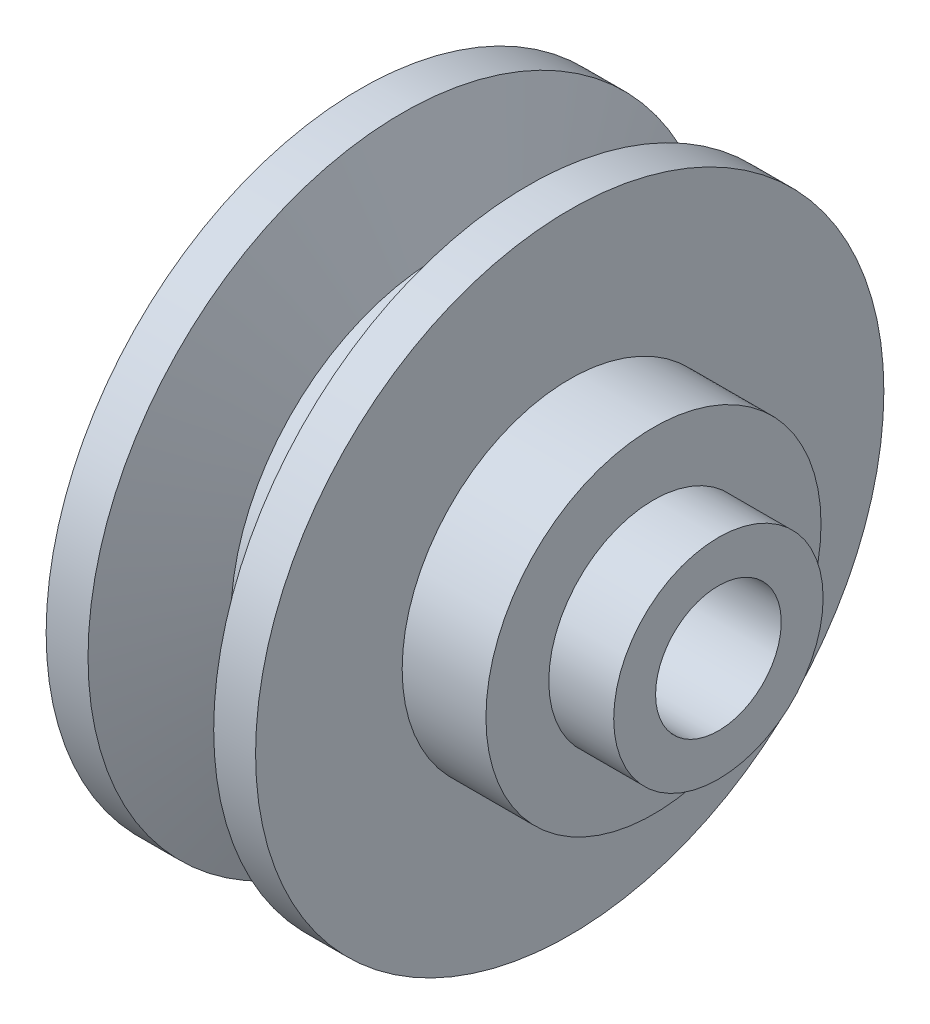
ISO-10303-21;
HEADER;
FILE_DESCRIPTION(('STEP AP214'),'2;1');
FILE_NAME('part.step','',(''),(''),'','','');
FILE_SCHEMA(('AUTOMOTIVE_DESIGN { 1 0 10303 214 1 1 1 1 }'));
ENDSEC;
DATA;
#1=APPLICATION_CONTEXT('core data for automotive mechanical design processes');
#2=APPLICATION_PROTOCOL_DEFINITION('international standard','automotive_design',2000,#1);
#3=PRODUCT_CONTEXT('',#1,'mechanical');
#4=PRODUCT('Part','Part','',(#3));
#5=PRODUCT_RELATED_PRODUCT_CATEGORY('part','',(#4));
#6=PRODUCT_DEFINITION_FORMATION('','',#4);
#7=PRODUCT_DEFINITION_CONTEXT('part definition',#1,'design');
#8=PRODUCT_DEFINITION('design','',#6,#7);
#9=PRODUCT_DEFINITION_SHAPE('','',#8);
#10=(LENGTH_UNIT() NAMED_UNIT(*) SI_UNIT(.MILLI.,.METRE.));
#11=(NAMED_UNIT(*) PLANE_ANGLE_UNIT() SI_UNIT($,.RADIAN.));
#12=(NAMED_UNIT(*) SI_UNIT($,.STERADIAN.) SOLID_ANGLE_UNIT());
#13=UNCERTAINTY_MEASURE_WITH_UNIT(LENGTH_MEASURE(1.E-05),#10,'distance_accuracy_value','');
#14=(GEOMETRIC_REPRESENTATION_CONTEXT(3) GLOBAL_UNCERTAINTY_ASSIGNED_CONTEXT((#13)) GLOBAL_UNIT_ASSIGNED_CONTEXT((#10,
#11,#12)) REPRESENTATION_CONTEXT('',''));
#15=CARTESIAN_POINT('',(0.,0.,0.));
#16=DIRECTION('',(0.,0.,1.));
#17=DIRECTION('',(1.,0.,0.));
#18=AXIS2_PLACEMENT_3D('',#15,#16,#17);
#19=CARTESIAN_POINT('',(0.,0.,0.));
#20=DIRECTION('',(-1.,0.,0.));
#21=DIRECTION('',(0.,0.,1.));
#22=AXIS2_PLACEMENT_3D('',#19,#20,#21);
#23=CYLINDRICAL_SURFACE('',#22,10.);
#24=CARTESIAN_POINT('',(6.18014882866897,0.,0.));
#25=DIRECTION('',(-1.,0.,0.));
#26=DIRECTION('',(0.,0.,1.));
#27=AXIS2_PLACEMENT_3D('',#24,#25,#26);
#28=CIRCLE('',#27,10.);
#29=CARTESIAN_POINT('',(6.18014882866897,0.,10.));
#30=VERTEX_POINT('',#29);
#31=EDGE_CURVE('E71',#30,#30,#28,.T.);
#32=ORIENTED_EDGE('',*,*,#31,.T.);
#33=EDGE_LOOP('',(#32));
#34=FACE_BOUND('',#33,.T.);
#35=CARTESIAN_POINT('',(3.819851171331,0.,0.));
#36=DIRECTION('',(-1.,0.,0.));
#37=DIRECTION('',(0.,0.,1.));
#38=AXIS2_PLACEMENT_3D('',#35,#36,#37);
#39=CIRCLE('',#38,10.);
#40=CARTESIAN_POINT('',(3.819851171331,0.,10.));
#41=VERTEX_POINT('',#40);
#42=EDGE_CURVE('E10',#41,#41,#39,.T.);
#43=ORIENTED_EDGE('',*,*,#42,.F.);
#44=EDGE_LOOP('',(#43));
#45=FACE_BOUND('',#44,.T.);
#46=ADVANCED_FACE('F28',(#34,#45),#23,.T.);
#47=CARTESIAN_POINT('',(2.00000000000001,0.,0.));
#48=DIRECTION('',(-1.,0.,0.));
#49=DIRECTION('',(0.,0.,1.));
#50=AXIS2_PLACEMENT_3D('',#47,#48,#49);
#51=CONICAL_SURFACE('',#50,15.,1.22173047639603);
#52=ORIENTED_EDGE('',*,*,#42,.T.);
#53=EDGE_LOOP('',(#52));
#54=FACE_BOUND('',#53,.T.);
#55=CARTESIAN_POINT('',(2.00000000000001,0.,0.));
#56=DIRECTION('',(-1.,0.,0.));
#57=DIRECTION('',(0.,0.,1.));
#58=AXIS2_PLACEMENT_3D('',#55,#56,#57);
#59=CIRCLE('',#58,15.);
#60=CARTESIAN_POINT('',(2.00000000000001,0.,15.));
#61=VERTEX_POINT('',#60);
#62=EDGE_CURVE('E34',#61,#61,#59,.T.);
#63=ORIENTED_EDGE('',*,*,#62,.F.);
#64=EDGE_LOOP('',(#63));
#65=FACE_BOUND('',#64,.T.);
#66=ADVANCED_FACE('F137',(#54,#65),#51,.T.);
#67=CARTESIAN_POINT('',(0.,0.,0.));
#68=DIRECTION('',(-1.,0.,0.));
#69=DIRECTION('',(0.,0.,1.));
#70=AXIS2_PLACEMENT_3D('',#67,#68,#69);
#71=CYLINDRICAL_SURFACE('',#70,15.);
#72=CARTESIAN_POINT('',(0.,0.,0.));
#73=DIRECTION('',(-1.,0.,0.));
#74=DIRECTION('',(0.,0.,1.));
#75=AXIS2_PLACEMENT_3D('',#72,#73,#74);
#76=CIRCLE('',#75,15.);
#77=CARTESIAN_POINT('',(0.,0.,15.));
#78=VERTEX_POINT('',#77);
#79=EDGE_CURVE('E38',#78,#78,#76,.T.);
#80=ORIENTED_EDGE('',*,*,#79,.F.);
#81=EDGE_LOOP('',(#80));
#82=FACE_BOUND('',#81,.T.);
#83=ORIENTED_EDGE('',*,*,#62,.T.);
#84=EDGE_LOOP('',(#83));
#85=FACE_BOUND('',#84,.T.);
#86=ADVANCED_FACE('F133',(#82,#85),#71,.T.);
#87=CARTESIAN_POINT('',(0.,0.,-7.49999999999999));
#88=DIRECTION('',(1.,0.,0.));
#89=DIRECTION('',(0.,0.,-1.));
#90=AXIS2_PLACEMENT_3D('',#87,#88,#89);
#91=PLANE('',#90);
#92=CARTESIAN_POINT('',(0.,0.,0.));
#93=DIRECTION('',(-1.,0.,0.));
#94=DIRECTION('',(0.,0.,1.));
#95=AXIS2_PLACEMENT_3D('',#92,#93,#94);
#96=CIRCLE('',#95,6.39999999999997);
#97=CARTESIAN_POINT('',(0.,0.,6.39999999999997));
#98=VERTEX_POINT('',#97);
#99=EDGE_CURVE('E42',#98,#98,#96,.T.);
#100=ORIENTED_EDGE('',*,*,#99,.F.);
#101=EDGE_LOOP('',(#100));
#102=FACE_BOUND('',#101,.T.);
#103=ORIENTED_EDGE('',*,*,#79,.T.);
#104=EDGE_LOOP('',(#103));
#105=FACE_BOUND('',#104,.T.);
#106=ADVANCED_FACE('F127',(#102,#105),#91,.F.);
#107=CARTESIAN_POINT('',(3.40000000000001,0.,0.));
#108=DIRECTION('',(-1.,0.,0.));
#109=DIRECTION('',(0.,0.,1.));
#110=AXIS2_PLACEMENT_3D('',#107,#108,#109);
#111=CONICAL_SURFACE('',#110,3.,0.785398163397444);
#112=ORIENTED_EDGE('',*,*,#99,.T.);
#113=EDGE_LOOP('',(#112));
#114=FACE_BOUND('',#113,.T.);
#115=CARTESIAN_POINT('',(3.40000000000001,0.,0.));
#116=DIRECTION('',(-1.,0.,0.));
#117=DIRECTION('',(0.,0.,1.));
#118=AXIS2_PLACEMENT_3D('',#115,#116,#117);
#119=CIRCLE('',#118,3.);
#120=CARTESIAN_POINT('',(3.40000000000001,0.,3.));
#121=VERTEX_POINT('',#120);
#122=EDGE_CURVE('E47',#121,#121,#119,.T.);
#123=ORIENTED_EDGE('',*,*,#122,.F.);
#124=EDGE_LOOP('',(#123));
#125=FACE_BOUND('',#124,.T.);
#126=ADVANCED_FACE('F122',(#114,#125),#111,.F.);
#127=CARTESIAN_POINT('',(0.,0.,0.));
#128=DIRECTION('',(-1.,0.,0.));
#129=DIRECTION('',(0.,0.,1.));
#130=AXIS2_PLACEMENT_3D('',#127,#128,#129);
#131=CYLINDRICAL_SURFACE('',#130,3.);
#132=CARTESIAN_POINT('',(17.1,0.,0.));
#133=DIRECTION('',(-1.,0.,0.));
#134=DIRECTION('',(0.,0.,1.));
#135=AXIS2_PLACEMENT_3D('',#132,#133,#134);
#136=CIRCLE('',#135,3.);
#137=CARTESIAN_POINT('',(17.1,0.,3.));
#138=VERTEX_POINT('',#137);
#139=EDGE_CURVE('E50',#138,#138,#136,.T.);
#140=ORIENTED_EDGE('',*,*,#139,.F.);
#141=EDGE_LOOP('',(#140));
#142=FACE_BOUND('',#141,.T.);
#143=ORIENTED_EDGE('',*,*,#122,.T.);
#144=EDGE_LOOP('',(#143));
#145=FACE_BOUND('',#144,.T.);
#146=ADVANCED_FACE('F116',(#142,#145),#131,.F.);
#147=CARTESIAN_POINT('',(17.1,0.,-7.5));
#148=DIRECTION('',(-1.,0.,0.));
#149=DIRECTION('',(0.,0.,1.));
#150=AXIS2_PLACEMENT_3D('',#147,#148,#149);
#151=PLANE('',#150);
#152=CARTESIAN_POINT('',(17.1,0.,0.));
#153=DIRECTION('',(-1.,0.,0.));
#154=DIRECTION('',(0.,0.,1.));
#155=AXIS2_PLACEMENT_3D('',#152,#153,#154);
#156=CIRCLE('',#155,5.);
#157=CARTESIAN_POINT('',(17.1,0.,5.));
#158=VERTEX_POINT('',#157);
#159=EDGE_CURVE('E53',#158,#158,#156,.T.);
#160=ORIENTED_EDGE('',*,*,#159,.F.);
#161=EDGE_LOOP('',(#160));
#162=FACE_BOUND('',#161,.T.);
#163=ORIENTED_EDGE('',*,*,#139,.T.);
#164=EDGE_LOOP('',(#163));
#165=FACE_BOUND('',#164,.T.);
#166=ADVANCED_FACE('F110',(#162,#165),#151,.F.);
#167=CARTESIAN_POINT('',(0.,0.,0.));
#168=DIRECTION('',(-1.,0.,0.));
#169=DIRECTION('',(0.,0.,1.));
#170=AXIS2_PLACEMENT_3D('',#167,#168,#169);
#171=CYLINDRICAL_SURFACE('',#170,5.);
#172=CARTESIAN_POINT('',(14.,0.,0.));
#173=DIRECTION('',(-1.,0.,0.));
#174=DIRECTION('',(0.,0.,1.));
#175=AXIS2_PLACEMENT_3D('',#172,#173,#174);
#176=CIRCLE('',#175,5.);
#177=CARTESIAN_POINT('',(14.,0.,5.));
#178=VERTEX_POINT('',#177);
#179=EDGE_CURVE('E56',#178,#178,#176,.T.);
#180=ORIENTED_EDGE('',*,*,#179,.F.);
#181=EDGE_LOOP('',(#180));
#182=FACE_BOUND('',#181,.T.);
#183=ORIENTED_EDGE('',*,*,#159,.T.);
#184=EDGE_LOOP('',(#183));
#185=FACE_BOUND('',#184,.T.);
#186=ADVANCED_FACE('F104',(#182,#185),#171,.T.);
#187=CARTESIAN_POINT('',(14.,0.,-7.5));
#188=DIRECTION('',(-1.,0.,0.));
#189=DIRECTION('',(0.,0.,1.));
#190=AXIS2_PLACEMENT_3D('',#187,#188,#189);
#191=PLANE('',#190);
#192=CARTESIAN_POINT('',(14.,0.,0.));
#193=DIRECTION('',(-1.,0.,0.));
#194=DIRECTION('',(0.,0.,1.));
#195=AXIS2_PLACEMENT_3D('',#192,#193,#194);
#196=CIRCLE('',#195,7.99999999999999);
#197=CARTESIAN_POINT('',(14.,0.,7.99999999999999));
#198=VERTEX_POINT('',#197);
#199=EDGE_CURVE('E59',#198,#198,#196,.T.);
#200=ORIENTED_EDGE('',*,*,#199,.F.);
#201=EDGE_LOOP('',(#200));
#202=FACE_BOUND('',#201,.T.);
#203=ORIENTED_EDGE('',*,*,#179,.T.);
#204=EDGE_LOOP('',(#203));
#205=FACE_BOUND('',#204,.T.);
#206=ADVANCED_FACE('F98',(#202,#205),#191,.F.);
#207=CARTESIAN_POINT('',(0.,0.,0.));
#208=DIRECTION('',(-1.,0.,0.));
#209=DIRECTION('',(0.,0.,1.));
#210=AXIS2_PLACEMENT_3D('',#207,#208,#209);
#211=CYLINDRICAL_SURFACE('',#210,7.99999999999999);
#212=CARTESIAN_POINT('',(10.,0.,0.));
#213=DIRECTION('',(-1.,0.,0.));
#214=DIRECTION('',(0.,0.,1.));
#215=AXIS2_PLACEMENT_3D('',#212,#213,#214);
#216=CIRCLE('',#215,7.99999999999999);
#217=CARTESIAN_POINT('',(10.,0.,7.99999999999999));
#218=VERTEX_POINT('',#217);
#219=EDGE_CURVE('E62',#218,#218,#216,.T.);
#220=ORIENTED_EDGE('',*,*,#219,.F.);
#221=EDGE_LOOP('',(#220));
#222=FACE_BOUND('',#221,.T.);
#223=ORIENTED_EDGE('',*,*,#199,.T.);
#224=EDGE_LOOP('',(#223));
#225=FACE_BOUND('',#224,.T.);
#226=ADVANCED_FACE('F92',(#222,#225),#211,.T.);
#227=CARTESIAN_POINT('',(10.,0.,-7.5));
#228=DIRECTION('',(-1.,0.,0.));
#229=DIRECTION('',(0.,0.,1.));
#230=AXIS2_PLACEMENT_3D('',#227,#228,#229);
#231=PLANE('',#230);
#232=CARTESIAN_POINT('',(10.,0.,0.));
#233=DIRECTION('',(-1.,0.,0.));
#234=DIRECTION('',(0.,0.,1.));
#235=AXIS2_PLACEMENT_3D('',#232,#233,#234);
#236=CIRCLE('',#235,15.);
#237=CARTESIAN_POINT('',(10.,0.,15.));
#238=VERTEX_POINT('',#237);
#239=EDGE_CURVE('E65',#238,#238,#236,.T.);
#240=ORIENTED_EDGE('',*,*,#239,.F.);
#241=EDGE_LOOP('',(#240));
#242=FACE_BOUND('',#241,.T.);
#243=ORIENTED_EDGE('',*,*,#219,.T.);
#244=EDGE_LOOP('',(#243));
#245=FACE_BOUND('',#244,.T.);
#246=ADVANCED_FACE('F86',(#242,#245),#231,.F.);
#247=CARTESIAN_POINT('',(0.,0.,0.));
#248=DIRECTION('',(-1.,0.,0.));
#249=DIRECTION('',(0.,0.,1.));
#250=AXIS2_PLACEMENT_3D('',#247,#248,#249);
#251=CYLINDRICAL_SURFACE('',#250,15.);
#252=CARTESIAN_POINT('',(8.00000000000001,0.,0.));
#253=DIRECTION('',(-1.,0.,0.));
#254=DIRECTION('',(0.,0.,1.));
#255=AXIS2_PLACEMENT_3D('',#252,#253,#254);
#256=CIRCLE('',#255,15.);
#257=CARTESIAN_POINT('',(8.00000000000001,0.,15.));
#258=VERTEX_POINT('',#257);
#259=EDGE_CURVE('E68',#258,#258,#256,.T.);
#260=ORIENTED_EDGE('',*,*,#259,.F.);
#261=EDGE_LOOP('',(#260));
#262=FACE_BOUND('',#261,.T.);
#263=ORIENTED_EDGE('',*,*,#239,.T.);
#264=EDGE_LOOP('',(#263));
#265=FACE_BOUND('',#264,.T.);
#266=ADVANCED_FACE('F80',(#262,#265),#251,.T.);
#267=CARTESIAN_POINT('',(8.00000000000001,0.,0.));
#268=DIRECTION('',(1.,0.,0.));
#269=DIRECTION('',(0.,0.,-1.));
#270=AXIS2_PLACEMENT_3D('',#267,#268,#269);
#271=CONICAL_SURFACE('',#270,15.,1.22173047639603);
#272=ORIENTED_EDGE('',*,*,#31,.F.);
#273=EDGE_LOOP('',(#272));
#274=FACE_BOUND('',#273,.T.);
#275=ORIENTED_EDGE('',*,*,#259,.T.);
#276=EDGE_LOOP('',(#275));
#277=FACE_BOUND('',#276,.T.);
#278=ADVANCED_FACE('F77',(#274,#277),#271,.T.);
#279=CLOSED_SHELL('',(#46,#66,#86,#106,#126,#146,#166,#186,#206,#226,#246,#266,#278));
#280=MANIFOLD_SOLID_BREP('B2',#279);
#281=ADVANCED_BREP_SHAPE_REPRESENTATION('',(#18,#280),#14);
#282=SHAPE_DEFINITION_REPRESENTATION(#9,#281);
ENDSEC;
END-ISO-10303-21;
